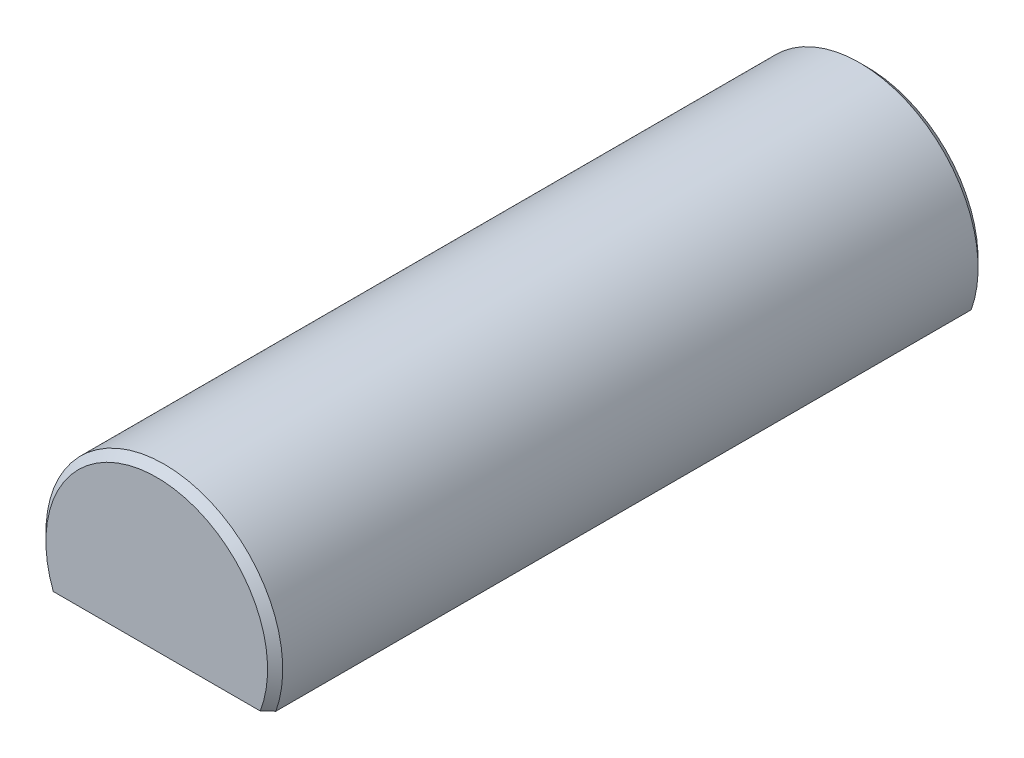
from build123d import *

# Parameters (mm, degrees)
SKETCH1_R            = 6.35
EXTRUDE1_DEPTH       = 19.05
CHAMFER1_SIZE        = 0.4064
TRUNCATED_DEPTH      = 22.060567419
TRUNCATED_DEPTH_BACK = 22.060567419
RECESSED_DEPTH       = 0.127
SKETCH4_R            = 2.5527
THREADED_DEPTH       = 6.35
CHAMFER2_SIZE        = 0.6223


with BuildPart() as part:
    # Sketch1 → Extrude1 (new, symmetric)
    with BuildSketch(Plane.XY):
        with Locations(Location((0, 0, 0), (0, 0, 180))):
            Circle(SKETCH1_R)
    extrude(amount=EXTRUDE1_DEPTH, both=True)

    # Chamfer1
    chamfer1_edges = [part.edges().sort_by_distance(p)[0] for p in [
        (6.35, 0, -19.05),
        (6.35, 0, 19.05),
    ]]
    chamfer(chamfer1_edges, length=CHAMFER1_SIZE)

    # Sketch2 → Truncated (cut, two sides: drawn at the far end of the back side and taken through both)
    with BuildSketch(Plane.XY.offset(-TRUNCATED_DEPTH_BACK)):
        with BuildLine():
            Line((-5.980823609, -2.1336), (5.980823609, -2.1336))
            ThreePointArc((5.980823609, -2.1336), (0, -6.35), (-5.980823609, -2.1336))
        make_face()
    extrude(amount=TRUNCATED_DEPTH + TRUNCATED_DEPTH_BACK, mode=Mode.SUBTRACT)

    # Sketch3 → Recessed (cut)
    with BuildSketch(Plane.XZ.offset(2.1336)):
        with BuildLine():
            Line((3.885323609, 17.4625), (-3.885323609, 17.4625))
            ThreePointArc((-3.885323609, 17.4625), (-4.244533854, 17.313710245), (-4.393323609, 16.9545))
            Line((-4.393323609, 16.9545), (-4.393323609, -16.9545))
            ThreePointArc((-4.393323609, -16.9545), (-4.244533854, -17.313710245), (-3.885323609, -17.4625))
            Line((-3.885323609, -17.4625), (3.885323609, -17.4625))
            ThreePointArc((3.885323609, -17.4625), (4.244533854, -17.313710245), (4.393323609, -16.9545))
            Line((4.393323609, -16.9545), (4.393323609, 16.9545))
            ThreePointArc((4.393323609, 16.9545), (4.244533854, 17.313710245), (3.885323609, 17.4625))
        make_face()
    extrude(amount=-RECESSED_DEPTH, mode=Mode.SUBTRACT)

    # Sketch4 → Threaded (cut)
    with BuildSketch(Plane.XZ.offset(2.1336)):
        with Locations(Location((0, 12.7, 0), (0, 0, 270))):
            Circle(SKETCH4_R)
        with Locations(Location((0, -12.7, 0), (0, 0, 270))):
            Circle(SKETCH4_R)
    extrude(amount=-THREADED_DEPTH, mode=Mode.SUBTRACT)

    # Chamfer2
    chamfer2_edges = [part.edges().sort_by_distance(p)[0] for p in [
        (0, -2.0066, 15.2527),
        (0, -2.0066, -10.1473),
    ]]
    chamfer(chamfer2_edges, length=CHAMFER2_SIZE)


solid = part.part
